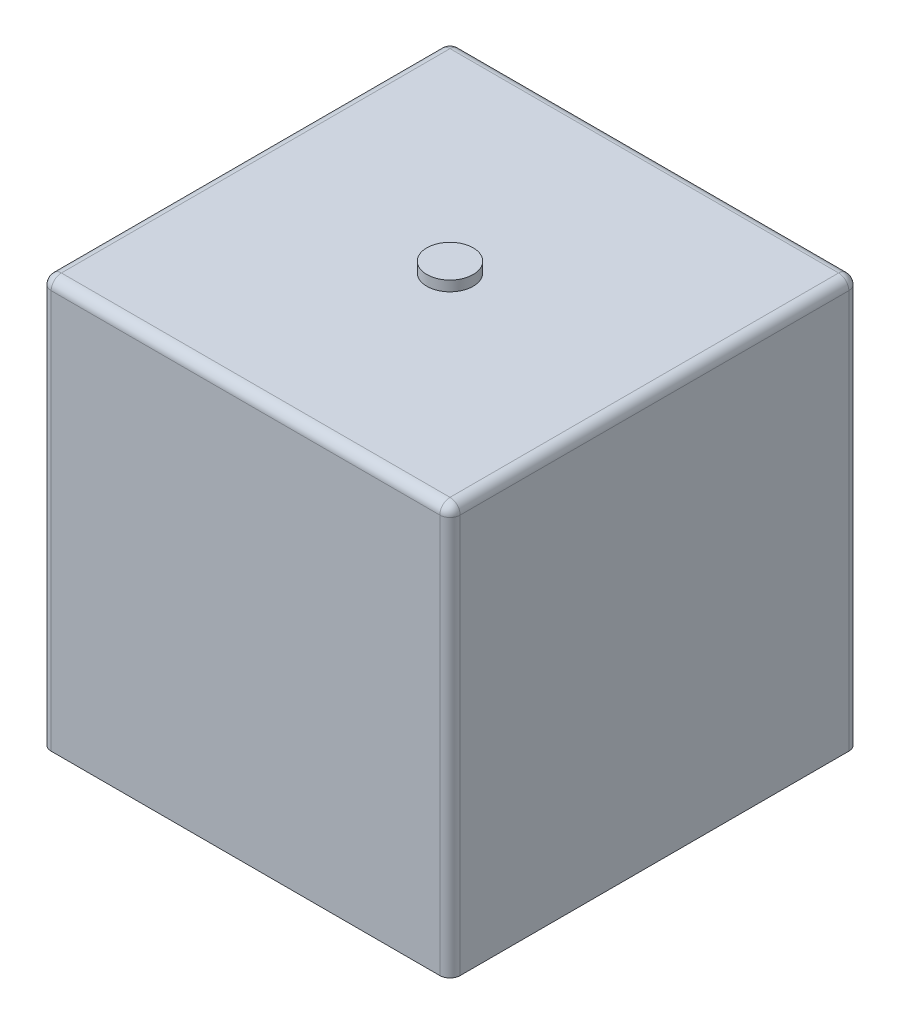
from build123d import *

# Parameters (mm, degrees)
SKETCH1_W           = 20
SKETCH1_H           = 20
BOSS_EXTRUDE1_DEPTH = 20
SKETCH2_R           = 1.131460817
BOSS_EXTRUDE2_DEPTH = 0.5
FILLET1_R           = 0.5


with BuildPart() as part:
    # Sketch1 → Boss-Extrude1 (new body)
    with BuildSketch(Plane.XY):
        with Locations((10, 10)):
            Rectangle(SKETCH1_W, SKETCH1_H)
    extrude(amount=BOSS_EXTRUDE1_DEPTH)

    # Sketch2 → Boss-Extrude2 (add)
    with BuildSketch(Plane(origin=(0, 20, 0), x_dir=(1, 0, 0), z_dir=(0, 1, 0))):
        with Locations(Location((10, -10, 0), (0, 0, 90))):
            Circle(SKETCH2_R)
    extrude(amount=BOSS_EXTRUDE2_DEPTH)

    # Fillet1
    fillet1_edges = [part.edges().sort_by_distance(p)[0] for p in [
        (20, 10, 20),
        (10, 20, 20),
        (0, 10, 20),
        (10, 20, 0),
        (20, 10, 0),
        (0, 10, 0),
        (0, 20, 10),
        (20, 20, 10),
    ]]
    fillet(fillet1_edges, radius=FILLET1_R)


solid = part.part
